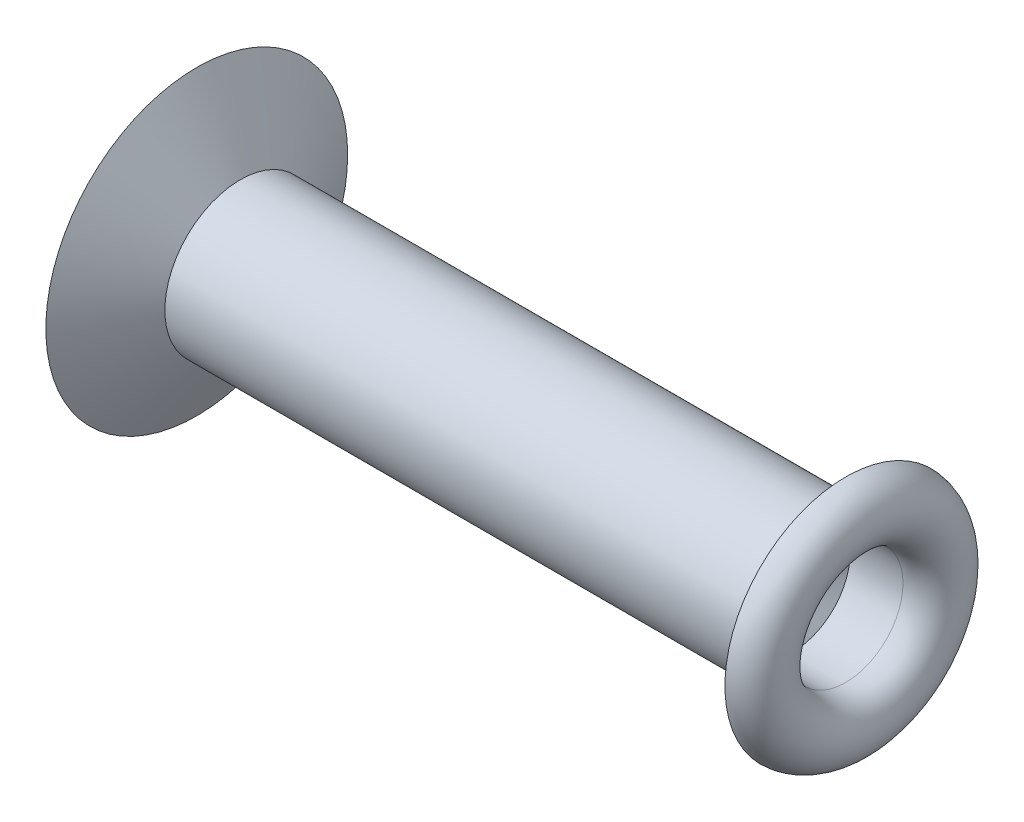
ISO-10303-21;
HEADER;
FILE_DESCRIPTION(('STEP AP214'),'2;1');
FILE_NAME('part.step','',(''),(''),'','','');
FILE_SCHEMA(('AUTOMOTIVE_DESIGN { 1 0 10303 214 1 1 1 1 }'));
ENDSEC;
DATA;
#1=APPLICATION_CONTEXT('core data for automotive mechanical design processes');
#2=APPLICATION_PROTOCOL_DEFINITION('international standard','automotive_design',2000,#1);
#3=PRODUCT_CONTEXT('',#1,'mechanical');
#4=PRODUCT('Part','Part','',(#3));
#5=PRODUCT_RELATED_PRODUCT_CATEGORY('part','',(#4));
#6=PRODUCT_DEFINITION_FORMATION('','',#4);
#7=PRODUCT_DEFINITION_CONTEXT('part definition',#1,'design');
#8=PRODUCT_DEFINITION('design','',#6,#7);
#9=PRODUCT_DEFINITION_SHAPE('','',#8);
#10=(LENGTH_UNIT() NAMED_UNIT(*) SI_UNIT(.MILLI.,.METRE.));
#11=(NAMED_UNIT(*) PLANE_ANGLE_UNIT() SI_UNIT($,.RADIAN.));
#12=(NAMED_UNIT(*) SI_UNIT($,.STERADIAN.) SOLID_ANGLE_UNIT());
#13=UNCERTAINTY_MEASURE_WITH_UNIT(LENGTH_MEASURE(1.E-05),#10,'distance_accuracy_value','');
#14=(GEOMETRIC_REPRESENTATION_CONTEXT(3) GLOBAL_UNCERTAINTY_ASSIGNED_CONTEXT((#13)) GLOBAL_UNIT_ASSIGNED_CONTEXT((#10,
#11,#12)) REPRESENTATION_CONTEXT('',''));
#15=CARTESIAN_POINT('',(0.,0.,0.));
#16=DIRECTION('',(0.,0.,1.));
#17=DIRECTION('',(1.,0.,0.));
#18=AXIS2_PLACEMENT_3D('',#15,#16,#17);
#19=CARTESIAN_POINT('',(-40.1132486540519,0.,0.));
#20=DIRECTION('',(-1.,0.,0.));
#21=DIRECTION('',(0.,0.,1.));
#22=AXIS2_PLACEMENT_3D('',#19,#20,#21);
#23=CONICAL_SURFACE('',#22,4.99999999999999,1.0471975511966);
#24=CARTESIAN_POINT('',(-43.,0.,0.));
#25=DIRECTION('',(1.,0.,0.));
#26=DIRECTION('',(0.,0.,-1.));
#27=AXIS2_PLACEMENT_3D('',#24,#25,#26);
#28=CIRCLE('',#27,9.99999999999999);
#29=CARTESIAN_POINT('',(-43.,0.,-9.99999999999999));
#30=VERTEX_POINT('',#29);
#31=EDGE_CURVE('E11',#30,#30,#28,.T.);
#32=ORIENTED_EDGE('',*,*,#31,.T.);
#33=EDGE_LOOP('',(#32));
#34=FACE_BOUND('',#33,.T.);
#35=CARTESIAN_POINT('',(-40.1132486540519,0.,0.));
#36=DIRECTION('',(1.,0.,0.));
#37=DIRECTION('',(0.,0.,-1.));
#38=AXIS2_PLACEMENT_3D('',#35,#36,#37);
#39=CIRCLE('',#38,4.99999999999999);
#40=CARTESIAN_POINT('',(-40.1132486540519,0.,-4.99999999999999));
#41=VERTEX_POINT('',#40);
#42=EDGE_CURVE('E71',#41,#41,#39,.T.);
#43=ORIENTED_EDGE('',*,*,#42,.F.);
#44=EDGE_LOOP('',(#43));
#45=FACE_BOUND('',#44,.T.);
#46=ADVANCED_FACE('F39',(#34,#45),#23,.T.);
#47=CARTESIAN_POINT('',(-43.,0.,0.));
#48=DIRECTION('',(-1.,0.,0.));
#49=DIRECTION('',(0.,0.,1.));
#50=AXIS2_PLACEMENT_3D('',#47,#48,#49);
#51=PLANE('',#50);
#52=ORIENTED_EDGE('',*,*,#31,.F.);
#53=EDGE_LOOP('',(#52));
#54=FACE_BOUND('',#53,.T.);
#55=ADVANCED_FACE('F51',(#54),#51,.T.);
#56=CARTESIAN_POINT('',(-5.78327035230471,0.,0.));
#57=DIRECTION('',(1.,0.,0.));
#58=DIRECTION('',(0.,0.,-1.));
#59=AXIS2_PLACEMENT_3D('',#56,#57,#58);
#60=CONICAL_SURFACE('',#59,0.,1.02974425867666);
#61=CARTESIAN_POINT('',(-3.5,0.,0.));
#62=DIRECTION('',(1.,0.,0.));
#63=DIRECTION('',(0.,0.,-1.));
#64=AXIS2_PLACEMENT_3D('',#61,#62,#63);
#65=CIRCLE('',#64,3.79999999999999);
#66=CARTESIAN_POINT('',(-3.5,0.,-3.79999999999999));
#67=VERTEX_POINT('',#66);
#68=EDGE_CURVE('E45',#67,#67,#65,.T.);
#69=ORIENTED_EDGE('',*,*,#68,.T.);
#70=EDGE_LOOP('',(#69));
#71=FACE_BOUND('',#70,.T.);
#72=CARTESIAN_POINT('',(-5.78327035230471,0.,0.));
#73=VERTEX_POINT('',#72);
#74=VERTEX_LOOP('',#73);
#75=FACE_BOUND('',#74,.T.);
#76=ADVANCED_FACE('F48',(#71,#75),#60,.F.);
#77=CARTESIAN_POINT('',(40.3769281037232,0.,0.));
#78=DIRECTION('',(1.,0.,0.));
#79=DIRECTION('',(0.,0.,-1.));
#80=AXIS2_PLACEMENT_3D('',#77,#78,#79);
#81=CYLINDRICAL_SURFACE('',#80,3.8);
#82=CARTESIAN_POINT('',(0.,0.,0.));
#83=DIRECTION('',(1.,0.,0.));
#84=DIRECTION('',(0.,0.,-1.));
#85=AXIS2_PLACEMENT_3D('',#82,#83,#84);
#86=CIRCLE('',#85,3.8);
#87=CARTESIAN_POINT('',(0.,0.,-3.8));
#88=VERTEX_POINT('',#87);
#89=EDGE_CURVE('E84',#88,#88,#86,.T.);
#90=ORIENTED_EDGE('',*,*,#89,.T.);
#91=EDGE_LOOP('',(#90));
#92=FACE_BOUND('',#91,.T.);
#93=ORIENTED_EDGE('',*,*,#68,.F.);
#94=EDGE_LOOP('',(#93));
#95=FACE_BOUND('',#94,.T.);
#96=ADVANCED_FACE('F50',(#92,#95),#81,.F.);
#97=CARTESIAN_POINT('',(-0.102499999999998,0.,0.));
#98=DIRECTION('',(1.,0.,0.));
#99=DIRECTION('',(0.,0.,-1.));
#100=AXIS2_PLACEMENT_3D('',#97,#98,#99);
#101=TOROIDAL_SURFACE('',#100,5.9,2.1025);
#102=CARTESIAN_POINT('',(0.,0.,0.));
#103=DIRECTION('',(1.,0.,0.));
#104=DIRECTION('',(0.,0.,-1.));
#105=AXIS2_PLACEMENT_3D('',#102,#103,#104);
#106=CIRCLE('',#105,8.);
#107=CARTESIAN_POINT('',(0.,0.,-8.));
#108=VERTEX_POINT('',#107);
#109=EDGE_CURVE('E81',#108,#108,#106,.T.);
#110=ORIENTED_EDGE('',*,*,#109,.T.);
#111=EDGE_LOOP('',(#110));
#112=FACE_BOUND('',#111,.T.);
#113=ORIENTED_EDGE('',*,*,#89,.F.);
#114=EDGE_LOOP('',(#113));
#115=FACE_BOUND('',#114,.T.);
#116=ADVANCED_FACE('F58',(#112,#115),#101,.T.);
#117=CARTESIAN_POINT('',(0.,8.,0.));
#118=DIRECTION('',(-1.,0.,0.));
#119=DIRECTION('',(0.,0.,1.));
#120=AXIS2_PLACEMENT_3D('',#117,#118,#119);
#121=PLANE('',#120);
#122=CARTESIAN_POINT('',(0.,0.,0.));
#123=DIRECTION('',(1.,0.,0.));
#124=DIRECTION('',(0.,0.,-1.));
#125=AXIS2_PLACEMENT_3D('',#122,#123,#124);
#126=CIRCLE('',#125,6.79414414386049);
#127=CARTESIAN_POINT('',(0.,0.,-6.79414414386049));
#128=VERTEX_POINT('',#127);
#129=EDGE_CURVE('E76',#128,#128,#126,.T.);
#130=ORIENTED_EDGE('',*,*,#129,.T.);
#131=EDGE_LOOP('',(#130));
#132=FACE_BOUND('',#131,.T.);
#133=ORIENTED_EDGE('',*,*,#109,.F.);
#134=EDGE_LOOP('',(#133));
#135=FACE_BOUND('',#134,.T.);
#136=ADVANCED_FACE('F91',(#132,#135),#121,.T.);
#137=CARTESIAN_POINT('',(-0.102499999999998,0.,0.));
#138=DIRECTION('',(1.,0.,0.));
#139=DIRECTION('',(0.,0.,-1.));
#140=AXIS2_PLACEMENT_3D('',#137,#138,#139);
#141=TOROIDAL_SURFACE('',#140,5.9,0.900000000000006);
#142=CARTESIAN_POINT('',(-0.102499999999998,0.,0.));
#143=DIRECTION('',(1.,0.,0.));
#144=DIRECTION('',(0.,0.,-1.));
#145=AXIS2_PLACEMENT_3D('',#142,#143,#144);
#146=CIRCLE('',#145,4.99999999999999);
#147=CARTESIAN_POINT('',(-0.102499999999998,0.,-4.99999999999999));
#148=VERTEX_POINT('',#147);
#149=EDGE_CURVE('E73',#148,#148,#146,.T.);
#150=ORIENTED_EDGE('',*,*,#149,.T.);
#151=EDGE_LOOP('',(#150));
#152=FACE_BOUND('',#151,.T.);
#153=ORIENTED_EDGE('',*,*,#129,.F.);
#154=EDGE_LOOP('',(#153));
#155=FACE_BOUND('',#154,.T.);
#156=ADVANCED_FACE('F97',(#152,#155),#141,.F.);
#157=CARTESIAN_POINT('',(40.3769281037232,0.,0.));
#158=DIRECTION('',(1.,0.,0.));
#159=DIRECTION('',(0.,0.,-1.));
#160=AXIS2_PLACEMENT_3D('',#157,#158,#159);
#161=CYLINDRICAL_SURFACE('',#160,4.99999999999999);
#162=ORIENTED_EDGE('',*,*,#42,.T.);
#163=EDGE_LOOP('',(#162));
#164=FACE_BOUND('',#163,.T.);
#165=ORIENTED_EDGE('',*,*,#149,.F.);
#166=EDGE_LOOP('',(#165));
#167=FACE_BOUND('',#166,.T.);
#168=ADVANCED_FACE('F103',(#164,#167),#161,.T.);
#169=CLOSED_SHELL('',(#46,#55,#76,#96,#116,#136,#156,#168));
#170=MANIFOLD_SOLID_BREP('B2',#169);
#171=ADVANCED_BREP_SHAPE_REPRESENTATION('',(#18,#170),#14);
#172=SHAPE_DEFINITION_REPRESENTATION(#9,#171);
ENDSEC;
END-ISO-10303-21;
